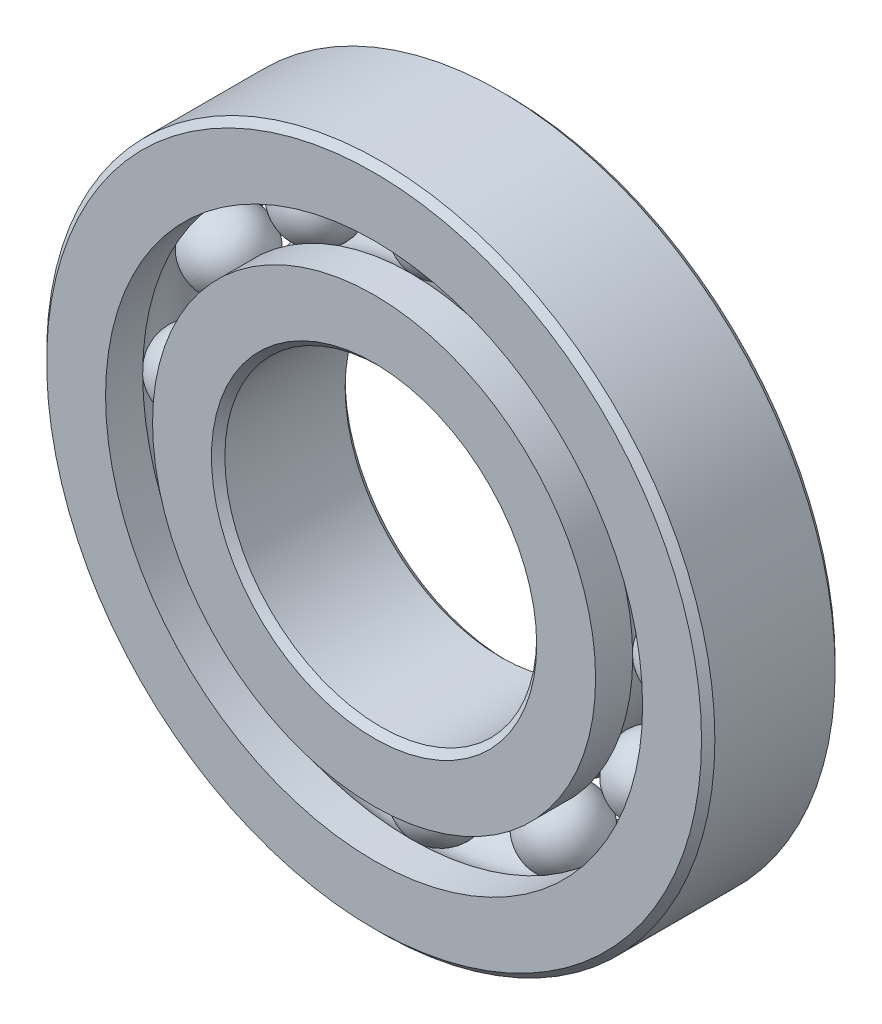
from build123d import *

# Parameters (mm, degrees)
CIRPATTERN1_COUNT = 12


with BuildPart() as part:
    # Sketch1 → Revolve1 (revolve)
    with BuildSketch(Plane(origin=(0, 0, 0), x_dir=(0, 0, -1), z_dir=(1, 0, 0)), mode=Mode.PRIVATE) as revolve1_sk:
        with BuildLine():
            Line((4.28625, 23.8125), (-4.28625, 23.8125))
            Line((-4.28625, 23.8125), (-4.7625, 23.33625))
            Line((-4.7625, 23.33625), (-4.7625, 19.137225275))
            Line((-4.7625, 19.137225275), (-2.116666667, 19.137225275))
            ThreePointArc((-2.116666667, 19.137225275), (0, 20.161570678), (2.116666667, 19.137225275))
            Line((2.116666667, 19.137225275), (4.7625, 19.137225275))
            Line((4.7625, 19.137225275), (4.7625, 23.33625))
            Line((4.7625, 23.33625), (4.28625, 23.8125))
        make_face()
    revolve(revolve1_sk.sketch.rotate(Axis((0, 0, 4.7625), (0, 0, -1)), 90), axis=Axis((0, 0, 4.7625), (0, 0, -1)))


with BuildPart() as body_2:
    # Sketch3 → Revolve3 (revolve)
    with BuildSketch(Plane(origin=(0, 0, 0), x_dir=(0, 0, -1), z_dir=(1, 0, 0)), mode=Mode.PRIVATE) as revolve3_sk:
        with BuildLine():
            Line((-4.7625, 15.787774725), (-2.116666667, 15.787774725))
            ThreePointArc((-2.116666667, 15.787774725), (0, 14.763429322), (2.116666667, 15.787774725))
            Line((2.116666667, 15.787774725), (4.7625, 15.787774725))
            Line((4.7625, 15.787774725), (4.7625, 11.58875))
            Line((4.7625, 11.58875), (4.28625, 11.1125))
            Line((4.28625, 11.1125), (-4.28625, 11.1125))
            Line((-4.28625, 11.1125), (-4.7625, 11.58875))
            Line((-4.7625, 11.58875), (-4.7625, 15.787774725))
        make_face()
    revolve(revolve3_sk.sketch.rotate(Axis((0, 0, 4.7625), (0, 0, -1)), 90), axis=Axis((0, 0, 4.7625), (0, 0, -1)))


with BuildPart() as body_3:
    # Sketch4 → Revolve4 (revolve)
    with BuildSketch(Plane(origin=(0, 0, 0), x_dir=(0, 0, -1), z_dir=(1, 0, 0))):
        with BuildLine():
            Line((-2.699070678, 17.4625), (2.699070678, 17.4625))
            ThreePointArc((2.699070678, 17.4625), (0, 20.161570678), (-2.699070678, 17.4625))
        make_face()
    revolve(axis=Axis((0, 17.4625, 2.699070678), (0, 0, -1)))


with BuildPart() as cirpattern1_1:
    # CirPattern1: pattern copy
    add(body_3.part.rotate(Axis((0, 0, 0), (0, 0, 1)), 1 * 360 / CIRPATTERN1_COUNT))


with BuildPart() as cirpattern1_2:
    # CirPattern1: pattern copy
    add(body_3.part.rotate(Axis((0, 0, 0), (0, 0, 1)), 2 * 360 / CIRPATTERN1_COUNT))


with BuildPart() as cirpattern1_3:
    # CirPattern1: pattern copy
    add(body_3.part.rotate(Axis((0, 0, 0), (0, 0, 1)), 3 * 360 / CIRPATTERN1_COUNT))


with BuildPart() as cirpattern1_4:
    # CirPattern1: pattern copy
    add(body_3.part.rotate(Axis((0, 0, 0), (0, 0, 1)), 4 * 360 / CIRPATTERN1_COUNT))


with BuildPart() as cirpattern1_5:
    # CirPattern1: pattern copy
    add(body_3.part.rotate(Axis((0, 0, 0), (0, 0, 1)), 5 * 360 / CIRPATTERN1_COUNT))


with BuildPart() as cirpattern1_6:
    # CirPattern1: pattern copy
    add(body_3.part.rotate(Axis((0, 0, 0), (0, 0, 1)), 6 * 360 / CIRPATTERN1_COUNT))


with BuildPart() as cirpattern1_7:
    # CirPattern1: pattern copy
    add(body_3.part.rotate(Axis((0, 0, 0), (0, 0, 1)), 7 * 360 / CIRPATTERN1_COUNT))


with BuildPart() as cirpattern1_8:
    # CirPattern1: pattern copy
    add(body_3.part.rotate(Axis((0, 0, 0), (0, 0, 1)), 8 * 360 / CIRPATTERN1_COUNT))


with BuildPart() as cirpattern1_9:
    # CirPattern1: pattern copy
    add(body_3.part.rotate(Axis((0, 0, 0), (0, 0, 1)), 9 * 360 / CIRPATTERN1_COUNT))


with BuildPart() as cirpattern1_10:
    # CirPattern1: pattern copy
    add(body_3.part.rotate(Axis((0, 0, 0), (0, 0, 1)), 10 * 360 / CIRPATTERN1_COUNT))


with BuildPart() as cirpattern1_11:
    # CirPattern1: pattern copy
    add(body_3.part.rotate(Axis((0, 0, 0), (0, 0, 1)), 11 * 360 / CIRPATTERN1_COUNT))


solid = Compound([part.part, body_2.part, body_3.part, cirpattern1_1.part, cirpattern1_2.part, cirpattern1_3.part, cirpattern1_4.part, cirpattern1_5.part, cirpattern1_6.part, cirpattern1_7.part, cirpattern1_8.part, cirpattern1_9.part, cirpattern1_10.part, cirpattern1_11.part])
